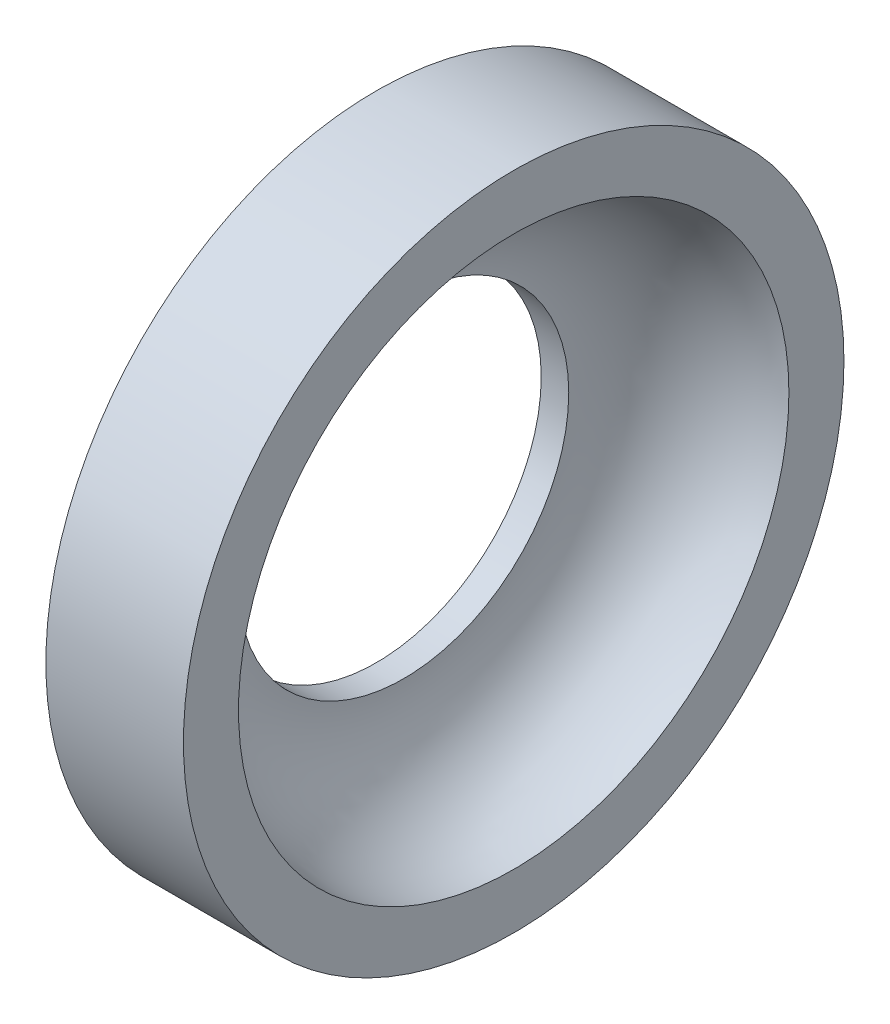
from build123d import *

# Parameters (mm, degrees)
ESQUISSE1_W             = 2.5
ESQUISSE1_H             = 6
ESQUISSE2_R             = 3
ENL_V_MAT_EXTRU_1_DEPTH = 6


with BuildPart() as part:
    # Esquisse1 → Base-R_volution (revolve)
    with BuildSketch(Plane.XY, mode=Mode.PRIVATE) as base_r_volution_sk:
        with Locations((-1.25, -3)):
            Rectangle(ESQUISSE1_W, ESQUISSE1_H)
    revolve(base_r_volution_sk.sketch.rotate(Axis((0, 0, 0), (-1, 0, 0)), 270), axis=Axis((0, 0, 0), (-1, 0, 0)))

    # Esquisse2 → Enl_v. mat.-Extru.1 (cut)
    with BuildSketch(Plane(origin=(0, 0, 0), x_dir=(0, 0, -1), z_dir=(1, 0, 0))):
        Circle(ESQUISSE2_R)
    extrude(amount=-ENL_V_MAT_EXTRU_1_DEPTH, mode=Mode.SUBTRACT)

    # Esquisse3 → Enl_vement de mati_re-R_volution1 (revolve, cut)
    with BuildSketch(Plane.XY, mode=Mode.PRIVATE) as enl_vement_de_mati_re_r_volution1_sk:
        with BuildLine():
            Line((-2, 3), (0, 5))
            ThreePointArc((0, 5), (-1.414213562, 4.414213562), (-2, 3))
        make_face()
    revolve(enl_vement_de_mati_re_r_volution1_sk.sketch.rotate(Axis((0, 0, 0), (-1, 0, 0)), 90), axis=Axis((0, 0, 0), (-1, 0, 0)), mode=Mode.SUBTRACT)


with BuildPart() as enl_vement_de_mati_re_r_volution1_kept_p:
    # of the separate pieces the step leaves, the one the design keeps (enl_vement_de_mati_re_r_volution1_pieces)
    add(part.part.solids().sort_by_distance((0, 0, -6))[0])


solid = enl_vement_de_mati_re_r_volution1_kept_p.part
